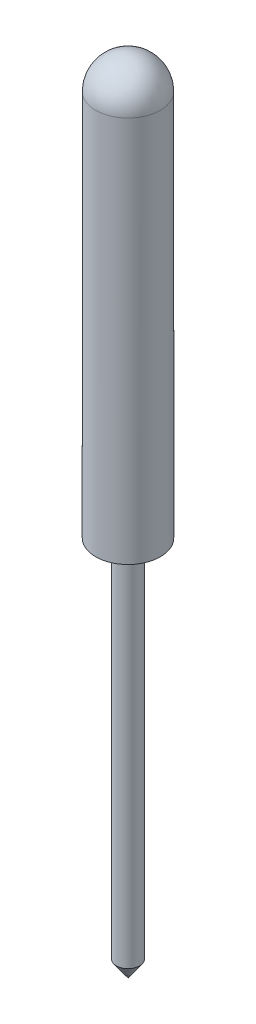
ISO-10303-21;
HEADER;
FILE_DESCRIPTION(('STEP AP214'),'2;1');
FILE_NAME('part.step','',(''),(''),'','','');
FILE_SCHEMA(('AUTOMOTIVE_DESIGN { 1 0 10303 214 1 1 1 1 }'));
ENDSEC;
DATA;
#1=APPLICATION_CONTEXT('core data for automotive mechanical design processes');
#2=APPLICATION_PROTOCOL_DEFINITION('international standard','automotive_design',2000,#1);
#3=PRODUCT_CONTEXT('',#1,'mechanical');
#4=PRODUCT('Part','Part','',(#3));
#5=PRODUCT_RELATED_PRODUCT_CATEGORY('part','',(#4));
#6=PRODUCT_DEFINITION_FORMATION('','',#4);
#7=PRODUCT_DEFINITION_CONTEXT('part definition',#1,'design');
#8=PRODUCT_DEFINITION('design','',#6,#7);
#9=PRODUCT_DEFINITION_SHAPE('','',#8);
#10=(LENGTH_UNIT() NAMED_UNIT(*) SI_UNIT(.MILLI.,.METRE.));
#11=(NAMED_UNIT(*) PLANE_ANGLE_UNIT() SI_UNIT($,.RADIAN.));
#12=(NAMED_UNIT(*) SI_UNIT($,.STERADIAN.) SOLID_ANGLE_UNIT());
#13=UNCERTAINTY_MEASURE_WITH_UNIT(LENGTH_MEASURE(1.E-05),#10,'distance_accuracy_value','');
#14=(GEOMETRIC_REPRESENTATION_CONTEXT(3) GLOBAL_UNCERTAINTY_ASSIGNED_CONTEXT((#13)) GLOBAL_UNIT_ASSIGNED_CONTEXT((#10,
#11,#12)) REPRESENTATION_CONTEXT('',''));
#15=CARTESIAN_POINT('',(0.,0.,0.));
#16=DIRECTION('',(0.,0.,1.));
#17=DIRECTION('',(1.,0.,0.));
#18=AXIS2_PLACEMENT_3D('',#15,#16,#17);
#19=CARTESIAN_POINT('',(0.,50.,0.));
#20=DIRECTION('',(0.,-1.,0.));
#21=DIRECTION('',(0.,0.,-1.));
#22=AXIS2_PLACEMENT_3D('',#19,#20,#21);
#23=CYLINDRICAL_SURFACE('',#22,1.524);
#24=CARTESIAN_POINT('',(0.,50.,0.));
#25=DIRECTION('',(0.,1.,0.));
#26=DIRECTION('',(0.,0.,1.));
#27=AXIS2_PLACEMENT_3D('',#24,#25,#26);
#28=CIRCLE('',#27,1.524);
#29=CARTESIAN_POINT('',(0.,50.,1.524));
#30=VERTEX_POINT('',#29);
#31=EDGE_CURVE('E13',#30,#30,#28,.T.);
#32=ORIENTED_EDGE('',*,*,#31,.F.);
#33=EDGE_LOOP('',(#32));
#34=FACE_BOUND('',#33,.T.);
#35=CARTESIAN_POINT('',(0.,2.13813509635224,0.));
#36=DIRECTION('',(0.,1.,0.));
#37=DIRECTION('',(0.,0.,1.));
#38=AXIS2_PLACEMENT_3D('',#35,#36,#37);
#39=CIRCLE('',#38,1.524);
#40=CARTESIAN_POINT('',(0.,2.13813509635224,1.524));
#41=VERTEX_POINT('',#40);
#42=EDGE_CURVE('E48',#41,#41,#39,.F.);
#43=ORIENTED_EDGE('',*,*,#42,.F.);
#44=EDGE_LOOP('',(#43));
#45=FACE_BOUND('',#44,.T.);
#46=ADVANCED_FACE('F44',(#34,#45),#23,.T.);
#47=CARTESIAN_POINT('',(0.,50.,0.));
#48=DIRECTION('',(0.,1.,0.));
#49=DIRECTION('',(0.,0.,1.));
#50=AXIS2_PLACEMENT_3D('',#47,#48,#49);
#51=PLANE('',#50);
#52=CARTESIAN_POINT('',(0.,50.,0.));
#53=DIRECTION('',(0.,1.,0.));
#54=DIRECTION('',(0.,0.,1.));
#55=AXIS2_PLACEMENT_3D('',#52,#53,#54);
#56=CIRCLE('',#55,4.25);
#57=CARTESIAN_POINT('',(0.,50.,-4.25));
#58=VERTEX_POINT('',#57);
#59=EDGE_CURVE('E63',#58,#58,#56,.T.);
#60=ORIENTED_EDGE('',*,*,#59,.F.);
#61=EDGE_LOOP('',(#60));
#62=FACE_BOUND('',#61,.T.);
#63=ORIENTED_EDGE('',*,*,#31,.T.);
#64=EDGE_LOOP('',(#63));
#65=FACE_BOUND('',#64,.T.);
#66=ADVANCED_FACE('F74',(#62,#65),#51,.F.);
#67=CARTESIAN_POINT('',(0.,100.75,0.));
#68=DIRECTION('',(0.,-1.,0.));
#69=DIRECTION('',(0.,0.,-1.));
#70=AXIS2_PLACEMENT_3D('',#67,#68,#69);
#71=CYLINDRICAL_SURFACE('',#70,4.25);
#72=CARTESIAN_POINT('',(0.,100.75,0.));
#73=DIRECTION('',(0.,1.,0.));
#74=DIRECTION('',(0.,0.,1.));
#75=AXIS2_PLACEMENT_3D('',#72,#73,#74);
#76=CIRCLE('',#75,4.25);
#77=CARTESIAN_POINT('',(0.,100.75,-4.25));
#78=VERTEX_POINT('',#77);
#79=EDGE_CURVE('E52',#78,#78,#76,.T.);
#80=CARTESIAN_POINT('',(0.,100.75,-4.25));
#81=CARTESIAN_POINT('',(0.,100.221354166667,-4.25));
#82=CARTESIAN_POINT('',(0.,99.6927083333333,-4.25));
#83=CARTESIAN_POINT('',(0.,98.6354166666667,-4.25));
#84=CARTESIAN_POINT('',(0.,98.1067708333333,-4.25));
#85=CARTESIAN_POINT('',(0.,97.0494791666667,-4.25));
#86=CARTESIAN_POINT('',(0.,96.5208333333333,-4.25));
#87=CARTESIAN_POINT('',(0.,95.4635416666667,-4.25));
#88=CARTESIAN_POINT('',(0.,94.9348958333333,-4.25));
#89=CARTESIAN_POINT('',(0.,93.8776041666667,-4.25));
#90=CARTESIAN_POINT('',(0.,93.3489583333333,-4.25));
#91=CARTESIAN_POINT('',(0.,92.2916666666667,-4.25));
#92=CARTESIAN_POINT('',(0.,91.7630208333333,-4.25));
#93=CARTESIAN_POINT('',(0.,90.7057291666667,-4.25));
#94=CARTESIAN_POINT('',(0.,90.1770833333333,-4.25));
#95=CARTESIAN_POINT('',(0.,89.1197916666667,-4.25));
#96=CARTESIAN_POINT('',(0.,88.5911458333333,-4.25));
#97=CARTESIAN_POINT('',(0.,87.5338541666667,-4.25));
#98=CARTESIAN_POINT('',(0.,87.0052083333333,-4.25));
#99=CARTESIAN_POINT('',(0.,85.9479166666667,-4.25));
#100=CARTESIAN_POINT('',(0.,85.4192708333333,-4.25));
#101=CARTESIAN_POINT('',(0.,84.3619791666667,-4.25));
#102=CARTESIAN_POINT('',(0.,83.8333333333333,-4.25));
#103=CARTESIAN_POINT('',(0.,82.7760416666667,-4.25));
#104=CARTESIAN_POINT('',(0.,82.2473958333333,-4.25));
#105=CARTESIAN_POINT('',(0.,81.1901041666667,-4.25));
#106=CARTESIAN_POINT('',(0.,80.6614583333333,-4.25));
#107=CARTESIAN_POINT('',(0.,79.6041666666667,-4.25));
#108=CARTESIAN_POINT('',(0.,79.0755208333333,-4.25));
#109=CARTESIAN_POINT('',(0.,78.0182291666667,-4.25));
#110=CARTESIAN_POINT('',(0.,77.4895833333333,-4.25));
#111=CARTESIAN_POINT('',(0.,76.4322916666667,-4.25));
#112=CARTESIAN_POINT('',(0.,75.9036458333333,-4.25));
#113=CARTESIAN_POINT('',(0.,74.8463541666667,-4.25));
#114=CARTESIAN_POINT('',(0.,74.3177083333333,-4.25));
#115=CARTESIAN_POINT('',(0.,73.2604166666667,-4.25));
#116=CARTESIAN_POINT('',(0.,72.7317708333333,-4.25));
#117=CARTESIAN_POINT('',(0.,71.6744791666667,-4.25));
#118=CARTESIAN_POINT('',(0.,71.1458333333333,-4.25));
#119=CARTESIAN_POINT('',(0.,70.0885416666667,-4.25));
#120=CARTESIAN_POINT('',(0.,69.5598958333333,-4.25));
#121=CARTESIAN_POINT('',(0.,68.5026041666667,-4.25));
#122=CARTESIAN_POINT('',(0.,67.9739583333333,-4.25));
#123=CARTESIAN_POINT('',(0.,66.9166666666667,-4.25));
#124=CARTESIAN_POINT('',(0.,66.3880208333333,-4.25));
#125=CARTESIAN_POINT('',(0.,65.3307291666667,-4.25));
#126=CARTESIAN_POINT('',(0.,64.8020833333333,-4.25));
#127=CARTESIAN_POINT('',(0.,63.7447916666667,-4.25));
#128=CARTESIAN_POINT('',(0.,63.2161458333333,-4.25));
#129=CARTESIAN_POINT('',(0.,62.1588541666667,-4.25));
#130=CARTESIAN_POINT('',(0.,61.6302083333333,-4.25));
#131=CARTESIAN_POINT('',(0.,60.5729166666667,-4.25));
#132=CARTESIAN_POINT('',(0.,60.0442708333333,-4.25));
#133=CARTESIAN_POINT('',(0.,58.9869791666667,-4.25));
#134=CARTESIAN_POINT('',(0.,58.4583333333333,-4.25));
#135=CARTESIAN_POINT('',(0.,57.4010416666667,-4.25));
#136=CARTESIAN_POINT('',(0.,56.8723958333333,-4.25));
#137=CARTESIAN_POINT('',(0.,55.8151041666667,-4.25));
#138=CARTESIAN_POINT('',(0.,55.2864583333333,-4.25));
#139=CARTESIAN_POINT('',(0.,54.2291666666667,-4.25));
#140=CARTESIAN_POINT('',(0.,53.7005208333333,-4.25));
#141=CARTESIAN_POINT('',(0.,52.6432291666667,-4.25));
#142=CARTESIAN_POINT('',(0.,52.1145833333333,-4.25));
#143=CARTESIAN_POINT('',(0.,51.0572916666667,-4.25));
#144=CARTESIAN_POINT('',(0.,50.5286458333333,-4.25));
#145=CARTESIAN_POINT('',(0.,50.,-4.25));
#146=B_SPLINE_CURVE_WITH_KNOTS('',3,(#80,#81,#82,#83,#84,#85,#86,#87,#88,#89,#90,#91,#92,#93,
#94,#95,#96,#97,#98,#99,#100,#101,#102,#103,#104,#105,#106,#107,#108,#109,#110,#111,#112,#113,
#114,#115,#116,#117,#118,#119,#120,#121,#122,#123,#124,#125,#126,#127,#128,#129,#130,#131,#132,
#133,#134,#135,#136,#137,#138,#139,#140,#141,#142,#143,#144,#145),.UNSPECIFIED.,.F.,.F.,(4,2,2,
2,2,2,2,2,2,2,2,2,2,2,2,2,2,2,2,2,2,2,2,2,2,2,2,2,2,2,2,2,4),(0.,1.5859375,3.17187499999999,
4.7578125,6.34375,7.92968749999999,9.51562499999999,11.1015625,12.6875,14.2734375,15.859375,
17.4453125,19.03125,20.6171875,22.203125,23.7890625,25.375,26.9609375,28.546875,30.1328125,
31.71875,33.3046875,34.890625,36.4765625,38.0625,39.6484375,41.234375,42.8203125,44.40625,
45.9921875,47.578125,49.1640625,50.75),.UNSPECIFIED.);
#147=EDGE_CURVE('BSEAM72',#78,#58,#146,.T.);
#148=ORIENTED_EDGE('',*,*,#79,.F.);
#149=ORIENTED_EDGE('',*,*,#59,.T.);
#150=ORIENTED_EDGE('',*,*,#147,.T.);
#151=ORIENTED_EDGE('',*,*,#147,.F.);
#152=EDGE_LOOP('',(#148,#150,#149,#151));
#153=FACE_BOUND('',#152,.T.);
#154=ADVANCED_FACE('F72',(#153),#71,.T.);
#155=CARTESIAN_POINT('',(0.,100.75,0.));
#156=DIRECTION('',(0.,0.,1.));
#157=DIRECTION('',(1.,0.,0.));
#158=AXIS2_PLACEMENT_3D('',#155,#156,#157);
#159=SPHERICAL_SURFACE('',#158,4.25);
#160=CARTESIAN_POINT('',(0.,100.75,0.));
#161=DIRECTION('',(0.,1.,0.));
#162=DIRECTION('',(0.,0.,1.));
#163=AXIS2_PLACEMENT_3D('',#160,#161,#162);
#164=SPHERICAL_SURFACE('',#163,4.25);
#165=ORIENTED_EDGE('',*,*,#79,.T.);
#166=EDGE_LOOP('',(#165));
#167=FACE_BOUND('',#166,.T.);
#168=ADVANCED_FACE('F46',(#167),#164,.T.);
#169=CARTESIAN_POINT('',(0.,0.,0.));
#170=DIRECTION('',(0.,1.,0.));
#171=DIRECTION('',(0.,0.,1.));
#172=AXIS2_PLACEMENT_3D('',#169,#170,#171);
#173=CONICAL_SURFACE('',#172,0.,0.619245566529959);
#174=CARTESIAN_POINT('',(0.,0.,0.));
#175=VERTEX_POINT('',#174);
#176=VERTEX_LOOP('',#175);
#177=FACE_BOUND('',#176,.T.);
#178=ORIENTED_EDGE('',*,*,#42,.T.);
#179=EDGE_LOOP('',(#178));
#180=FACE_BOUND('',#179,.T.);
#181=ADVANCED_FACE('F56',(#177,#180),#173,.T.);
#182=CLOSED_SHELL('',(#46,#66,#154,#168,#181));
#183=MANIFOLD_SOLID_BREP('B2',#182);
#184=ADVANCED_BREP_SHAPE_REPRESENTATION('',(#18,#183),#14);
#185=SHAPE_DEFINITION_REPRESENTATION(#9,#184);
ENDSEC;
END-ISO-10303-21;
